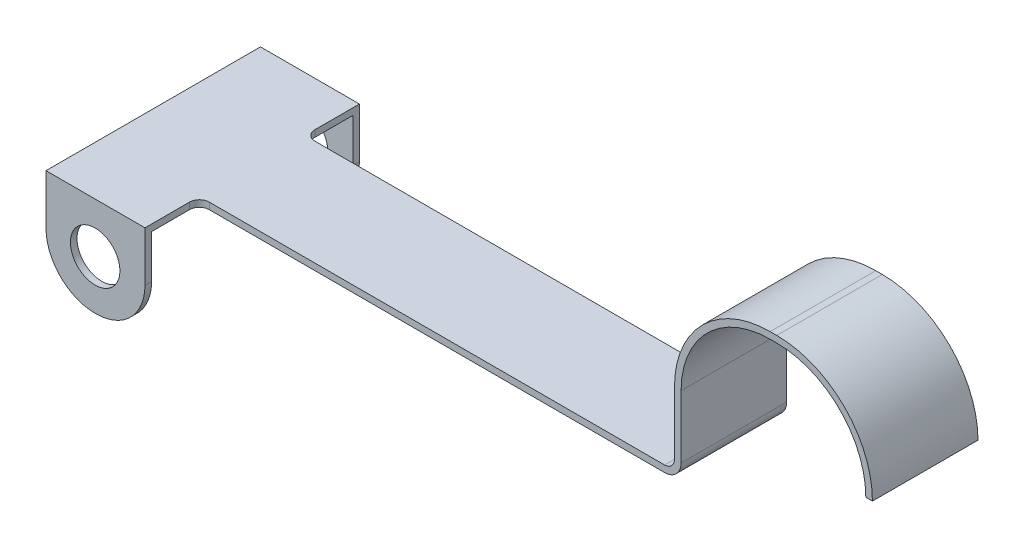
ISO-10303-21;
HEADER;
FILE_DESCRIPTION(('STEP AP214'),'2;1');
FILE_NAME('part.step','',(''),(''),'','','');
FILE_SCHEMA(('AUTOMOTIVE_DESIGN { 1 0 10303 214 1 1 1 1 }'));
ENDSEC;
DATA;
#1=APPLICATION_CONTEXT('core data for automotive mechanical design processes');
#2=APPLICATION_PROTOCOL_DEFINITION('international standard','automotive_design',2000,#1);
#3=PRODUCT_CONTEXT('',#1,'mechanical');
#4=PRODUCT('Part','Part','',(#3));
#5=PRODUCT_RELATED_PRODUCT_CATEGORY('part','',(#4));
#6=PRODUCT_DEFINITION_FORMATION('','',#4);
#7=PRODUCT_DEFINITION_CONTEXT('part definition',#1,'design');
#8=PRODUCT_DEFINITION('design','',#6,#7);
#9=PRODUCT_DEFINITION_SHAPE('','',#8);
#10=(LENGTH_UNIT() NAMED_UNIT(*) SI_UNIT(.MILLI.,.METRE.));
#11=(NAMED_UNIT(*) PLANE_ANGLE_UNIT() SI_UNIT($,.RADIAN.));
#12=(NAMED_UNIT(*) SI_UNIT($,.STERADIAN.) SOLID_ANGLE_UNIT());
#13=UNCERTAINTY_MEASURE_WITH_UNIT(LENGTH_MEASURE(1.E-05),#10,'distance_accuracy_value','');
#14=(GEOMETRIC_REPRESENTATION_CONTEXT(3) GLOBAL_UNCERTAINTY_ASSIGNED_CONTEXT((#13)) GLOBAL_UNIT_ASSIGNED_CONTEXT((#10,
#11,#12)) REPRESENTATION_CONTEXT('',''));
#15=CARTESIAN_POINT('',(0.,0.,0.));
#16=DIRECTION('',(0.,0.,1.));
#17=DIRECTION('',(1.,0.,0.));
#18=AXIS2_PLACEMENT_3D('',#15,#16,#17);
#19=CARTESIAN_POINT('',(-33.8702877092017,6.33331943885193,6.5));
#20=DIRECTION('',(0.,0.,-1.));
#21=DIRECTION('',(-1.,0.,0.));
#22=AXIS2_PLACEMENT_3D('',#19,#20,#21);
#23=CYLINDRICAL_SURFACE('',#22,1.49);
#24=DIRECTION('',(0.,0.,-1.));
#25=VECTOR('',#24,1.);
#26=CARTESIAN_POINT('',(-33.8702877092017,4.84331943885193,6.5));
#27=LINE('',#26,#25);
#28=CARTESIAN_POINT('',(-33.8702877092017,4.84331943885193,0.200000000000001));
#29=VERTEX_POINT('',#28);
#30=CARTESIAN_POINT('',(-33.8702877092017,4.84331943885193,0.));
#31=VERTEX_POINT('',#30);
#32=EDGE_CURVE('E413',#29,#31,#27,.T.);
#33=ORIENTED_EDGE('',*,*,#32,.F.);
#34=CARTESIAN_POINT('',(-33.8702877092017,6.33331943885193,0.200000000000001));
#35=DIRECTION('',(0.,0.,-1.));
#36=DIRECTION('',(-1.,0.,0.));
#37=AXIS2_PLACEMENT_3D('',#34,#35,#36);
#38=CIRCLE('',#37,1.49);
#39=CARTESIAN_POINT('',(-35.3602877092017,6.33331943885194,0.200000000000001));
#40=VERTEX_POINT('',#39);
#41=EDGE_CURVE('E271',#29,#40,#38,.T.);
#42=ORIENTED_EDGE('',*,*,#41,.T.);
#43=DIRECTION('',(0.,0.,-1.));
#44=VECTOR('',#43,1.);
#45=CARTESIAN_POINT('',(-35.3602877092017,6.33331943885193,6.5));
#46=LINE('',#45,#44);
#47=CARTESIAN_POINT('',(-35.3602877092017,6.33331943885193,0.));
#48=VERTEX_POINT('',#47);
#49=EDGE_CURVE('E417',#40,#48,#46,.T.);
#50=ORIENTED_EDGE('',*,*,#49,.T.);
#51=CARTESIAN_POINT('',(-33.8702877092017,6.33331943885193,0.));
#52=DIRECTION('',(0.,0.,1.));
#53=DIRECTION('',(1.,0.,0.));
#54=AXIS2_PLACEMENT_3D('',#51,#52,#53);
#55=CIRCLE('',#54,1.49);
#56=EDGE_CURVE('E340',#48,#31,#55,.T.);
#57=ORIENTED_EDGE('',*,*,#56,.T.);
#58=EDGE_LOOP('',(#33,#42,#50,#57));
#59=FACE_BOUND('',#58,.T.);
#60=ADVANCED_FACE('F31',(#59),#23,.T.);
#61=CARTESIAN_POINT('',(-33.8702877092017,4.84331943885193,6.5));
#62=DIRECTION('',(0.,1.,0.));
#63=DIRECTION('',(0.,0.,1.));
#64=AXIS2_PLACEMENT_3D('',#61,#62,#63);
#65=PLANE('',#64);
#66=DIRECTION('',(0.,0.,-1.));
#67=VECTOR('',#66,1.);
#68=CARTESIAN_POINT('',(-33.8502877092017,4.84331943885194,6.5));
#69=LINE('',#68,#67);
#70=CARTESIAN_POINT('',(-33.8502877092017,4.84331943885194,0.200000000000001));
#71=VERTEX_POINT('',#70);
#72=CARTESIAN_POINT('',(-33.8502877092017,4.84331943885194,0.));
#73=VERTEX_POINT('',#72);
#74=EDGE_CURVE('E409',#71,#73,#69,.T.);
#75=ORIENTED_EDGE('',*,*,#74,.F.);
#76=DIRECTION('',(-1.,0.,0.));
#77=VECTOR('',#76,1.);
#78=CARTESIAN_POINT('',(-33.8702877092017,4.84331943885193,0.200000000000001));
#79=LINE('',#78,#77);
#80=EDGE_CURVE('E268',#71,#29,#79,.T.);
#81=ORIENTED_EDGE('',*,*,#80,.T.);
#82=ORIENTED_EDGE('',*,*,#32,.T.);
#83=DIRECTION('',(1.,0.,0.));
#84=VECTOR('',#83,1.);
#85=CARTESIAN_POINT('',(-33.8702877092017,4.84331943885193,0.));
#86=LINE('',#85,#84);
#87=EDGE_CURVE('E343',#31,#73,#86,.T.);
#88=ORIENTED_EDGE('',*,*,#87,.T.);
#89=EDGE_LOOP('',(#75,#81,#82,#88));
#90=FACE_BOUND('',#89,.T.);
#91=ADVANCED_FACE('F543',(#90),#65,.F.);
#92=CARTESIAN_POINT('',(-33.8502877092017,6.33331943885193,6.5));
#93=DIRECTION('',(0.,0.,-1.));
#94=DIRECTION('',(-1.,0.,0.));
#95=AXIS2_PLACEMENT_3D('',#92,#93,#94);
#96=CYLINDRICAL_SURFACE('',#95,1.49);
#97=DIRECTION('',(0.,0.,-1.));
#98=VECTOR('',#97,1.);
#99=CARTESIAN_POINT('',(-32.3602877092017,6.33331943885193,6.5));
#100=LINE('',#99,#98);
#101=CARTESIAN_POINT('',(-32.3602877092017,6.33331943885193,0.200000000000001));
#102=VERTEX_POINT('',#101);
#103=CARTESIAN_POINT('',(-32.3602877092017,6.33331943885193,0.));
#104=VERTEX_POINT('',#103);
#105=EDGE_CURVE('E405',#102,#104,#100,.T.);
#106=ORIENTED_EDGE('',*,*,#105,.F.);
#107=CARTESIAN_POINT('',(-33.8502877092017,6.33331943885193,0.200000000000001));
#108=DIRECTION('',(0.,0.,-1.));
#109=DIRECTION('',(-1.,0.,0.));
#110=AXIS2_PLACEMENT_3D('',#107,#108,#109);
#111=CIRCLE('',#110,1.49);
#112=EDGE_CURVE('E265',#102,#71,#111,.T.);
#113=ORIENTED_EDGE('',*,*,#112,.T.);
#114=ORIENTED_EDGE('',*,*,#74,.T.);
#115=CARTESIAN_POINT('',(-33.8502877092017,6.33331943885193,0.));
#116=DIRECTION('',(0.,0.,1.));
#117=DIRECTION('',(1.,0.,0.));
#118=AXIS2_PLACEMENT_3D('',#115,#116,#117);
#119=CIRCLE('',#118,1.49);
#120=EDGE_CURVE('E346',#73,#104,#119,.T.);
#121=ORIENTED_EDGE('',*,*,#120,.T.);
#122=EDGE_LOOP('',(#106,#113,#114,#121));
#123=FACE_BOUND('',#122,.T.);
#124=ADVANCED_FACE('F545',(#123),#96,.T.);
#125=CARTESIAN_POINT('',(-32.3602877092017,7.34331943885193,6.5));
#126=DIRECTION('',(-1.,0.,0.));
#127=DIRECTION('',(0.,-1.,0.));
#128=AXIS2_PLACEMENT_3D('',#125,#126,#127);
#129=PLANE('',#128);
#130=DIRECTION('',(0.,0.,-1.));
#131=VECTOR('',#130,1.);
#132=CARTESIAN_POINT('',(-32.3602877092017,7.64331943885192,6.5));
#133=LINE('',#132,#131);
#134=CARTESIAN_POINT('',(-32.3602877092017,7.64331943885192,1.35));
#135=VERTEX_POINT('',#134);
#136=CARTESIAN_POINT('',(-32.3602877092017,7.64331943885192,0.200000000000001));
#137=VERTEX_POINT('',#136);
#138=EDGE_CURVE('E250',#135,#137,#133,.T.);
#139=ORIENTED_EDGE('',*,*,#138,.T.);
#140=DIRECTION('',(0.,-1.,0.));
#141=VECTOR('',#140,1.);
#142=CARTESIAN_POINT('',(-32.3602877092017,7.34331943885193,0.200000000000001));
#143=LINE('',#142,#141);
#144=EDGE_CURVE('E262',#137,#102,#143,.T.);
#145=ORIENTED_EDGE('',*,*,#144,.T.);
#146=ORIENTED_EDGE('',*,*,#105,.T.);
#147=DIRECTION('',(0.,1.,0.));
#148=VECTOR('',#147,1.);
#149=CARTESIAN_POINT('',(-32.3602877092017,7.34331943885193,0.));
#150=LINE('',#149,#148);
#151=CARTESIAN_POINT('',(-32.3602877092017,7.84331943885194,0.));
#152=VERTEX_POINT('',#151);
#153=EDGE_CURVE('E349',#104,#152,#150,.T.);
#154=ORIENTED_EDGE('',*,*,#153,.T.);
#155=DIRECTION('',(0.,0.,1.));
#156=VECTOR('',#155,1.);
#157=CARTESIAN_POINT('',(-32.3602877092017,7.84331943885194,6.5));
#158=LINE('',#157,#156);
#159=CARTESIAN_POINT('',(-32.3602877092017,7.84331943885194,1.35));
#160=VERTEX_POINT('',#159);
#161=EDGE_CURVE('E424',#152,#160,#158,.T.);
#162=ORIENTED_EDGE('',*,*,#161,.T.);
#163=DIRECTION('',(0.,1.,0.));
#164=VECTOR('',#163,1.);
#165=CARTESIAN_POINT('',(-32.3602877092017,4.84331943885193,1.35));
#166=LINE('',#165,#164);
#167=EDGE_CURVE('E285',#135,#160,#166,.T.);
#168=ORIENTED_EDGE('',*,*,#167,.F.);
#169=EDGE_LOOP('',(#139,#145,#146,#154,#162,#168));
#170=FACE_BOUND('',#169,.T.);
#171=ADVANCED_FACE('F437',(#170),#129,.F.);
#172=CARTESIAN_POINT('',(-33.8702877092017,6.33331943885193,6.5));
#173=DIRECTION('',(0.,0.,-1.));
#174=DIRECTION('',(-1.,0.,0.));
#175=AXIS2_PLACEMENT_3D('',#172,#173,#174);
#176=CYLINDRICAL_SURFACE('',#175,0.749999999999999);
#177=CARTESIAN_POINT('',(-33.8702877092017,6.33331943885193,0.200000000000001));
#178=DIRECTION('',(0.,0.,-1.));
#179=DIRECTION('',(-1.,0.,0.));
#180=AXIS2_PLACEMENT_3D('',#177,#178,#179);
#181=CIRCLE('',#180,0.749999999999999);
#182=CARTESIAN_POINT('',(-34.6202877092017,6.33331943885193,0.200000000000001));
#183=VERTEX_POINT('',#182);
#184=EDGE_CURVE('E35',#183,#183,#181,.T.);
#185=CARTESIAN_POINT('',(-33.8702877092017,6.33331943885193,0.));
#186=DIRECTION('',(0.,0.,1.));
#187=DIRECTION('',(1.,0.,0.));
#188=AXIS2_PLACEMENT_3D('',#185,#186,#187);
#189=CIRCLE('',#188,0.749999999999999);
#190=CARTESIAN_POINT('',(-34.6202877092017,6.33331943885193,0.));
#191=VERTEX_POINT('',#190);
#192=EDGE_CURVE('E331',#191,#191,#189,.T.);
#193=CARTESIAN_POINT('',(-34.6202877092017,6.33331943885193,0.200000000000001));
#194=CARTESIAN_POINT('',(-34.6202877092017,6.33331943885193,0.197916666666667));
#195=CARTESIAN_POINT('',(-34.6202877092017,6.33331943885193,0.195833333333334));
#196=CARTESIAN_POINT('',(-34.6202877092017,6.33331943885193,0.191666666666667));
#197=CARTESIAN_POINT('',(-34.6202877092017,6.33331943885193,0.189583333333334));
#198=CARTESIAN_POINT('',(-34.6202877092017,6.33331943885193,0.185416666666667));
#199=CARTESIAN_POINT('',(-34.6202877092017,6.33331943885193,0.183333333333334));
#200=CARTESIAN_POINT('',(-34.6202877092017,6.33331943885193,0.179166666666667));
#201=CARTESIAN_POINT('',(-34.6202877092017,6.33331943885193,0.177083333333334));
#202=CARTESIAN_POINT('',(-34.6202877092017,6.33331943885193,0.172916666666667));
#203=CARTESIAN_POINT('',(-34.6202877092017,6.33331943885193,0.170833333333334));
#204=CARTESIAN_POINT('',(-34.6202877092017,6.33331943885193,0.166666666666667));
#205=CARTESIAN_POINT('',(-34.6202877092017,6.33331943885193,0.164583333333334));
#206=CARTESIAN_POINT('',(-34.6202877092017,6.33331943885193,0.160416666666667));
#207=CARTESIAN_POINT('',(-34.6202877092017,6.33331943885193,0.158333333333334));
#208=CARTESIAN_POINT('',(-34.6202877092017,6.33331943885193,0.154166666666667));
#209=CARTESIAN_POINT('',(-34.6202877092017,6.33331943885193,0.152083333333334));
#210=CARTESIAN_POINT('',(-34.6202877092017,6.33331943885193,0.147916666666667));
#211=CARTESIAN_POINT('',(-34.6202877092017,6.33331943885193,0.145833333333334));
#212=CARTESIAN_POINT('',(-34.6202877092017,6.33331943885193,0.141666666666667));
#213=CARTESIAN_POINT('',(-34.6202877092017,6.33331943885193,0.139583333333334));
#214=CARTESIAN_POINT('',(-34.6202877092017,6.33331943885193,0.135416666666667));
#215=CARTESIAN_POINT('',(-34.6202877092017,6.33331943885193,0.133333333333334));
#216=CARTESIAN_POINT('',(-34.6202877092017,6.33331943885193,0.129166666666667));
#217=CARTESIAN_POINT('',(-34.6202877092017,6.33331943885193,0.127083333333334));
#218=CARTESIAN_POINT('',(-34.6202877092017,6.33331943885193,0.122916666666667));
#219=CARTESIAN_POINT('',(-34.6202877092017,6.33331943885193,0.120833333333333));
#220=CARTESIAN_POINT('',(-34.6202877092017,6.33331943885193,0.116666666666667));
#221=CARTESIAN_POINT('',(-34.6202877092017,6.33331943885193,0.114583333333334));
#222=CARTESIAN_POINT('',(-34.6202877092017,6.33331943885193,0.110416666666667));
#223=CARTESIAN_POINT('',(-34.6202877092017,6.33331943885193,0.108333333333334));
#224=CARTESIAN_POINT('',(-34.6202877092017,6.33331943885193,0.104166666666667));
#225=CARTESIAN_POINT('',(-34.6202877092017,6.33331943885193,0.102083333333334));
#226=CARTESIAN_POINT('',(-34.6202877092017,6.33331943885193,0.0979166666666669));
#227=CARTESIAN_POINT('',(-34.6202877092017,6.33331943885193,0.0958333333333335));
#228=CARTESIAN_POINT('',(-34.6202877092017,6.33331943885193,0.0916666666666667));
#229=CARTESIAN_POINT('',(-34.6202877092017,6.33331943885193,0.0895833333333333));
#230=CARTESIAN_POINT('',(-34.6202877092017,6.33331943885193,0.0854166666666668));
#231=CARTESIAN_POINT('',(-34.6202877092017,6.33331943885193,0.0833333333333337));
#232=CARTESIAN_POINT('',(-34.6202877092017,6.33331943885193,0.0791666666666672));
#233=CARTESIAN_POINT('',(-34.6202877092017,6.33331943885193,0.0770833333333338));
#234=CARTESIAN_POINT('',(-34.6202877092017,6.33331943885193,0.072916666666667));
#235=CARTESIAN_POINT('',(-34.6202877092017,6.33331943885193,0.0708333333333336));
#236=CARTESIAN_POINT('',(-34.6202877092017,6.33331943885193,0.0666666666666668));
#237=CARTESIAN_POINT('',(-34.6202877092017,6.33331943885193,0.0645833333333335));
#238=CARTESIAN_POINT('',(-34.6202877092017,6.33331943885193,0.0604166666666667));
#239=CARTESIAN_POINT('',(-34.6202877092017,6.33331943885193,0.0583333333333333));
#240=CARTESIAN_POINT('',(-34.6202877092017,6.33331943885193,0.0541666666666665));
#241=CARTESIAN_POINT('',(-34.6202877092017,6.33331943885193,0.0520833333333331));
#242=CARTESIAN_POINT('',(-34.6202877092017,6.33331943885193,0.0479166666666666));
#243=CARTESIAN_POINT('',(-34.6202877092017,6.33331943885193,0.0458333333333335));
#244=CARTESIAN_POINT('',(-34.6202877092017,6.33331943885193,0.041666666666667));
#245=CARTESIAN_POINT('',(-34.6202877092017,6.33331943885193,0.0395833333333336));
#246=CARTESIAN_POINT('',(-34.6202877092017,6.33331943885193,0.0354166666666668));
#247=CARTESIAN_POINT('',(-34.6202877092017,6.33331943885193,0.0333333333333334));
#248=CARTESIAN_POINT('',(-34.6202877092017,6.33331943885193,0.0291666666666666));
#249=CARTESIAN_POINT('',(-34.6202877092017,6.33331943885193,0.0270833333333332));
#250=CARTESIAN_POINT('',(-34.6202877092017,6.33331943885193,0.0229166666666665));
#251=CARTESIAN_POINT('',(-34.6202877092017,6.33331943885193,0.0208333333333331));
#252=CARTESIAN_POINT('',(-34.6202877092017,6.33331943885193,0.0166666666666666));
#253=CARTESIAN_POINT('',(-34.6202877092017,6.33331943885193,0.0145833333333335));
#254=CARTESIAN_POINT('',(-34.6202877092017,6.33331943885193,0.010416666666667));
#255=CARTESIAN_POINT('',(-34.6202877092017,6.33331943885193,0.00833333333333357));
#256=CARTESIAN_POINT('',(-34.6202877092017,6.33331943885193,0.00416666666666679));
#257=CARTESIAN_POINT('',(-34.6202877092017,6.33331943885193,0.00208333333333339));
#258=CARTESIAN_POINT('',(-34.6202877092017,6.33331943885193,0.));
#259=B_SPLINE_CURVE_WITH_KNOTS('',3,(#193,#194,#195,#196,#197,#198,#199,#200,#201,#202,#203,
#204,#205,#206,#207,#208,#209,#210,#211,#212,#213,#214,#215,#216,#217,#218,#219,#220,#221,#222,
#223,#224,#225,#226,#227,#228,#229,#230,#231,#232,#233,#234,#235,#236,#237,#238,#239,#240,#241,
#242,#243,#244,#245,#246,#247,#248,#249,#250,#251,#252,#253,#254,#255,#256,#257,#258),
.UNSPECIFIED.,.F.,.F.,(4,2,2,2,2,2,2,2,2,2,2,2,2,2,2,2,2,2,2,2,2,2,2,2,2,2,2,2,2,2,2,2,4),(0.,
0.00625000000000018,0.0125000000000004,0.0187499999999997,0.0249999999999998,0.03125,
0.0375000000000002,0.0437500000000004,0.0499999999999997,0.0562499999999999,0.0625000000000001,
0.0687500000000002,0.0750000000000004,0.0812500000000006,0.0874999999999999,0.0937500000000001,
0.1,0.10625,0.112500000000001,0.11875,0.125,0.13125,0.1375,0.143750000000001,0.150000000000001,
0.15625,0.1625,0.168750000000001,0.175000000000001,0.181250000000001,0.1875,0.19375,
0.200000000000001),.UNSPECIFIED.);
#260=EDGE_CURVE('BSEAM552',#183,#191,#259,.T.);
#261=ORIENTED_EDGE('',*,*,#184,.F.);
#262=ORIENTED_EDGE('',*,*,#192,.F.);
#263=ORIENTED_EDGE('',*,*,#260,.T.);
#264=ORIENTED_EDGE('',*,*,#260,.F.);
#265=EDGE_LOOP('',(#261,#263,#262,#264));
#266=FACE_BOUND('',#265,.T.);
#267=ADVANCED_FACE('F552',(#266),#176,.F.);
#268=CARTESIAN_POINT('',(-33.8702877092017,6.33331943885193,6.5));
#269=DIRECTION('',(0.,0.,1.));
#270=DIRECTION('',(1.,0.,0.));
#271=AXIS2_PLACEMENT_3D('',#268,#269,#270);
#272=PLANE('',#271);
#273=CARTESIAN_POINT('',(-33.8702877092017,6.33331943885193,6.5));
#274=DIRECTION('',(0.,0.,1.));
#275=DIRECTION('',(1.,0.,0.));
#276=AXIS2_PLACEMENT_3D('',#273,#274,#275);
#277=CIRCLE('',#276,0.749999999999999);
#278=CARTESIAN_POINT('',(-34.6202877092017,6.33331943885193,6.5));
#279=VERTEX_POINT('',#278);
#280=EDGE_CURVE('E334',#279,#279,#277,.T.);
#281=ORIENTED_EDGE('',*,*,#280,.F.);
#282=EDGE_LOOP('',(#281));
#283=FACE_BOUND('',#282,.T.);
#284=DIRECTION('',(0.,1.,0.));
#285=VECTOR('',#284,1.);
#286=CARTESIAN_POINT('',(-32.3602877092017,7.34331943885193,6.5));
#287=LINE('',#286,#285);
#288=CARTESIAN_POINT('',(-32.3602877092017,6.33331943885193,6.5));
#289=VERTEX_POINT('',#288);
#290=CARTESIAN_POINT('',(-32.3602877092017,7.84331943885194,6.5));
#291=VERTEX_POINT('',#290);
#292=EDGE_CURVE('E362',#289,#291,#287,.T.);
#293=ORIENTED_EDGE('',*,*,#292,.T.);
#294=DIRECTION('',(-1.,0.,0.));
#295=VECTOR('',#294,1.);
#296=CARTESIAN_POINT('',(-32.3602877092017,7.84331943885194,6.5));
#297=LINE('',#296,#295);
#298=CARTESIAN_POINT('',(-35.3602877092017,7.84331943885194,6.5));
#299=VERTEX_POINT('',#298);
#300=EDGE_CURVE('E364',#291,#299,#297,.T.);
#301=ORIENTED_EDGE('',*,*,#300,.T.);
#302=DIRECTION('',(0.,-1.,0.));
#303=VECTOR('',#302,1.);
#304=CARTESIAN_POINT('',(-35.3602877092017,7.84331943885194,6.5));
#305=LINE('',#304,#303);
#306=CARTESIAN_POINT('',(-35.3602877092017,6.33331943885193,6.5));
#307=VERTEX_POINT('',#306);
#308=EDGE_CURVE('E353',#299,#307,#305,.T.);
#309=ORIENTED_EDGE('',*,*,#308,.T.);
#310=CARTESIAN_POINT('',(-33.8702877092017,6.33331943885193,6.5));
#311=DIRECTION('',(0.,0.,1.));
#312=DIRECTION('',(1.,0.,0.));
#313=AXIS2_PLACEMENT_3D('',#310,#311,#312);
#314=CIRCLE('',#313,1.49);
#315=CARTESIAN_POINT('',(-33.8702877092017,4.84331943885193,6.5));
#316=VERTEX_POINT('',#315);
#317=EDGE_CURVE('E356',#307,#316,#314,.T.);
#318=ORIENTED_EDGE('',*,*,#317,.T.);
#319=DIRECTION('',(1.,0.,0.));
#320=VECTOR('',#319,1.);
#321=CARTESIAN_POINT('',(-33.8702877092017,4.84331943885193,6.5));
#322=LINE('',#321,#320);
#323=CARTESIAN_POINT('',(-33.8502877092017,4.84331943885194,6.5));
#324=VERTEX_POINT('',#323);
#325=EDGE_CURVE('E358',#316,#324,#322,.T.);
#326=ORIENTED_EDGE('',*,*,#325,.T.);
#327=CARTESIAN_POINT('',(-33.8502877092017,6.33331943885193,6.5));
#328=DIRECTION('',(0.,0.,1.));
#329=DIRECTION('',(1.,0.,0.));
#330=AXIS2_PLACEMENT_3D('',#327,#328,#329);
#331=CIRCLE('',#330,1.49);
#332=EDGE_CURVE('E360',#324,#289,#331,.T.);
#333=ORIENTED_EDGE('',*,*,#332,.T.);
#334=EDGE_LOOP('',(#293,#301,#309,#318,#326,#333));
#335=FACE_BOUND('',#334,.T.);
#336=ADVANCED_FACE('F517',(#283,#335),#272,.T.);
#337=CARTESIAN_POINT('',(-33.8702877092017,6.33331943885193,0.));
#338=DIRECTION('',(0.,0.,1.));
#339=DIRECTION('',(1.,0.,0.));
#340=AXIS2_PLACEMENT_3D('',#337,#338,#339);
#341=PLANE('',#340);
#342=ORIENTED_EDGE('',*,*,#192,.T.);
#343=EDGE_LOOP('',(#342));
#344=FACE_BOUND('',#343,.T.);
#345=DIRECTION('',(-1.,0.,0.));
#346=VECTOR('',#345,1.);
#347=CARTESIAN_POINT('',(-35.3602877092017,7.84331943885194,0.));
#348=LINE('',#347,#346);
#349=CARTESIAN_POINT('',(-35.3602877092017,7.84331943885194,0.));
#350=VERTEX_POINT('',#349);
#351=EDGE_CURVE('E351',#152,#350,#348,.T.);
#352=ORIENTED_EDGE('',*,*,#351,.F.);
#353=ORIENTED_EDGE('',*,*,#153,.F.);
#354=ORIENTED_EDGE('',*,*,#120,.F.);
#355=ORIENTED_EDGE('',*,*,#87,.F.);
#356=ORIENTED_EDGE('',*,*,#56,.F.);
#357=DIRECTION('',(0.,-1.,0.));
#358=VECTOR('',#357,1.);
#359=CARTESIAN_POINT('',(-35.3602877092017,7.84331943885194,0.));
#360=LINE('',#359,#358);
#361=EDGE_CURVE('E337',#350,#48,#360,.T.);
#362=ORIENTED_EDGE('',*,*,#361,.F.);
#363=EDGE_LOOP('',(#352,#353,#354,#355,#356,#362));
#364=FACE_BOUND('',#363,.T.);
#365=ADVANCED_FACE('F533',(#344,#364),#341,.F.);
#366=CARTESIAN_POINT('',(-32.0602877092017,7.64331943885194,6.5));
#367=DIRECTION('',(0.,1.,0.));
#368=DIRECTION('',(0.,0.,1.));
#369=AXIS2_PLACEMENT_3D('',#366,#367,#368);
#370=PLANE('',#369);
#371=DIRECTION('',(1.,0.,0.));
#372=VECTOR('',#371,1.);
#373=CARTESIAN_POINT('',(-32.0602877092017,7.64331943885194,4.85));
#374=LINE('',#373,#372);
#375=CARTESIAN_POINT('',(-32.0602877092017,7.64331943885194,4.85));
#376=VERTEX_POINT('',#375);
#377=CARTESIAN_POINT('',(-18.2602877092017,7.64331943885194,4.85));
#378=VERTEX_POINT('',#377);
#379=EDGE_CURVE('E329',#376,#378,#374,.T.);
#380=ORIENTED_EDGE('',*,*,#379,.F.);
#381=CARTESIAN_POINT('',(-32.0602877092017,7.64331943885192,5.15));
#382=DIRECTION('',(0.,1.,0.));
#383=DIRECTION('',(-1.,0.,0.));
#384=AXIS2_PLACEMENT_3D('',#381,#382,#383);
#385=CIRCLE('',#384,0.300000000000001);
#386=CARTESIAN_POINT('',(-32.3602877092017,7.64331943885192,5.15));
#387=VERTEX_POINT('',#386);
#388=EDGE_CURVE('E12',#376,#387,#385,.T.);
#389=ORIENTED_EDGE('',*,*,#388,.T.);
#390=CARTESIAN_POINT('',(-32.3602877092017,7.64331943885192,6.3));
#391=VERTEX_POINT('',#390);
#392=EDGE_CURVE('E240',#391,#387,#133,.T.);
#393=ORIENTED_EDGE('',*,*,#392,.F.);
#394=DIRECTION('',(-1.,0.,0.));
#395=VECTOR('',#394,1.);
#396=CARTESIAN_POINT('',(-11.9602877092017,7.64331943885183,6.3));
#397=LINE('',#396,#395);
#398=CARTESIAN_POINT('',(-35.3602877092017,7.64331943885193,6.3));
#399=VERTEX_POINT('',#398);
#400=EDGE_CURVE('E223',#391,#399,#397,.T.);
#401=ORIENTED_EDGE('',*,*,#400,.T.);
#402=DIRECTION('',(0.,0.,-1.));
#403=VECTOR('',#402,1.);
#404=CARTESIAN_POINT('',(-35.3602877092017,7.64331943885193,0.200000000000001));
#405=LINE('',#404,#403);
#406=CARTESIAN_POINT('',(-35.3602877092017,7.64331943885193,0.200000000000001));
#407=VERTEX_POINT('',#406);
#408=EDGE_CURVE('E231',#399,#407,#405,.T.);
#409=ORIENTED_EDGE('',*,*,#408,.T.);
#410=DIRECTION('',(-1.,0.,0.));
#411=VECTOR('',#410,1.);
#412=CARTESIAN_POINT('',(-11.9602877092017,7.64331943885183,0.200000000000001));
#413=LINE('',#412,#411);
#414=EDGE_CURVE('E241',#137,#407,#413,.T.);
#415=ORIENTED_EDGE('',*,*,#414,.F.);
#416=ORIENTED_EDGE('',*,*,#138,.F.);
#417=CARTESIAN_POINT('',(-32.0602877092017,7.64331943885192,1.35));
#418=DIRECTION('',(0.,1.,0.));
#419=DIRECTION('',(-1.,0.,0.));
#420=AXIS2_PLACEMENT_3D('',#417,#418,#419);
#421=CIRCLE('',#420,0.300000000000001);
#422=CARTESIAN_POINT('',(-32.0602877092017,7.64331943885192,1.65));
#423=VERTEX_POINT('',#422);
#424=EDGE_CURVE('E249',#135,#423,#421,.T.);
#425=ORIENTED_EDGE('',*,*,#424,.T.);
#426=DIRECTION('',(-1.,0.,0.));
#427=VECTOR('',#426,1.);
#428=CARTESIAN_POINT('',(-32.0602877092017,7.64331943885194,1.65));
#429=LINE('',#428,#427);
#430=CARTESIAN_POINT('',(-18.2602877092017,7.64331943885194,1.65));
#431=VERTEX_POINT('',#430);
#432=EDGE_CURVE('E307',#431,#423,#429,.T.);
#433=ORIENTED_EDGE('',*,*,#432,.F.);
#434=DIRECTION('',(0.,0.,-1.));
#435=VECTOR('',#434,1.);
#436=CARTESIAN_POINT('',(-18.2602877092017,7.64331943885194,6.5));
#437=LINE('',#436,#435);
#438=EDGE_CURVE('E402',#378,#431,#437,.T.);
#439=ORIENTED_EDGE('',*,*,#438,.F.);
#440=EDGE_LOOP('',(#380,#389,#393,#401,#409,#415,#416,#425,#433,#439));
#441=FACE_BOUND('',#440,.T.);
#442=ADVANCED_FACE('F237',(#441),#370,.F.);
#443=CARTESIAN_POINT('',(-18.2602877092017,8.14331943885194,6.5));
#444=DIRECTION('',(0.,0.,-1.));
#445=DIRECTION('',(-1.,0.,0.));
#446=AXIS2_PLACEMENT_3D('',#443,#444,#445);
#447=CYLINDRICAL_SURFACE('',#446,0.5);
#448=CARTESIAN_POINT('',(-18.2602877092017,8.14331943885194,4.85));
#449=DIRECTION('',(0.,0.,1.));
#450=DIRECTION('',(1.,0.,0.));
#451=AXIS2_PLACEMENT_3D('',#448,#449,#450);
#452=CIRCLE('',#451,0.5);
#453=CARTESIAN_POINT('',(-17.7602877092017,8.14331943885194,4.85));
#454=VERTEX_POINT('',#453);
#455=EDGE_CURVE('E327',#378,#454,#452,.T.);
#456=ORIENTED_EDGE('',*,*,#455,.F.);
#457=ORIENTED_EDGE('',*,*,#438,.T.);
#458=CARTESIAN_POINT('',(-18.2602877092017,8.14331943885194,1.65));
#459=DIRECTION('',(0.,0.,-1.));
#460=DIRECTION('',(-1.,0.,0.));
#461=AXIS2_PLACEMENT_3D('',#458,#459,#460);
#462=CIRCLE('',#461,0.5);
#463=CARTESIAN_POINT('',(-17.7602877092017,8.14331943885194,1.65));
#464=VERTEX_POINT('',#463);
#465=EDGE_CURVE('E305',#464,#431,#462,.T.);
#466=ORIENTED_EDGE('',*,*,#465,.F.);
#467=DIRECTION('',(0.,0.,-1.));
#468=VECTOR('',#467,1.);
#469=CARTESIAN_POINT('',(-17.7602877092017,8.14331943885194,6.5));
#470=LINE('',#469,#468);
#471=EDGE_CURVE('E399',#454,#464,#470,.T.);
#472=ORIENTED_EDGE('',*,*,#471,.F.);
#473=EDGE_LOOP('',(#456,#457,#466,#472));
#474=FACE_BOUND('',#473,.T.);
#475=ADVANCED_FACE('F502',(#474),#447,.T.);
#476=CARTESIAN_POINT('',(-17.7602877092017,8.14331943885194,6.5));
#477=DIRECTION('',(-1.,0.,0.));
#478=DIRECTION('',(0.,0.,1.));
#479=AXIS2_PLACEMENT_3D('',#476,#477,#478);
#480=PLANE('',#479);
#481=DIRECTION('',(0.,1.,0.));
#482=VECTOR('',#481,1.);
#483=CARTESIAN_POINT('',(-17.7602877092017,8.14331943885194,4.85));
#484=LINE('',#483,#482);
#485=CARTESIAN_POINT('',(-17.7602877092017,10.0433194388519,4.85));
#486=VERTEX_POINT('',#485);
#487=EDGE_CURVE('E325',#454,#486,#484,.T.);
#488=ORIENTED_EDGE('',*,*,#487,.F.);
#489=ORIENTED_EDGE('',*,*,#471,.T.);
#490=DIRECTION('',(0.,-1.,0.));
#491=VECTOR('',#490,1.);
#492=CARTESIAN_POINT('',(-17.7602877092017,8.14331943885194,1.65));
#493=LINE('',#492,#491);
#494=CARTESIAN_POINT('',(-17.7602877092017,10.0433194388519,1.65));
#495=VERTEX_POINT('',#494);
#496=EDGE_CURVE('E303',#495,#464,#493,.T.);
#497=ORIENTED_EDGE('',*,*,#496,.F.);
#498=DIRECTION('',(0.,0.,-1.));
#499=VECTOR('',#498,1.);
#500=CARTESIAN_POINT('',(-17.7602877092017,10.0433194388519,6.5));
#501=LINE('',#500,#499);
#502=EDGE_CURVE('E396',#486,#495,#501,.T.);
#503=ORIENTED_EDGE('',*,*,#502,.F.);
#504=EDGE_LOOP('',(#488,#489,#497,#503));
#505=FACE_BOUND('',#504,.T.);
#506=ADVANCED_FACE('F497',(#505),#480,.F.);
#507=CARTESIAN_POINT('',(-15.0602877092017,10.0433194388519,6.5));
#508=DIRECTION('',(0.,0.,-1.));
#509=DIRECTION('',(-1.,0.,0.));
#510=AXIS2_PLACEMENT_3D('',#507,#508,#509);
#511=CYLINDRICAL_SURFACE('',#510,2.7);
#512=CARTESIAN_POINT('',(-15.0602877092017,10.0433194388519,4.85));
#513=DIRECTION('',(0.,0.,1.));
#514=DIRECTION('',(1.,0.,0.));
#515=AXIS2_PLACEMENT_3D('',#512,#513,#514);
#516=CIRCLE('',#515,2.7);
#517=CARTESIAN_POINT('',(-15.0602877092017,12.7433194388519,4.85));
#518=VERTEX_POINT('',#517);
#519=EDGE_CURVE('E323',#486,#518,#516,.F.);
#520=ORIENTED_EDGE('',*,*,#519,.F.);
#521=ORIENTED_EDGE('',*,*,#502,.T.);
#522=CARTESIAN_POINT('',(-15.0602877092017,10.0433194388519,1.65));
#523=DIRECTION('',(0.,0.,-1.));
#524=DIRECTION('',(-1.,0.,0.));
#525=AXIS2_PLACEMENT_3D('',#522,#523,#524);
#526=CIRCLE('',#525,2.7);
#527=CARTESIAN_POINT('',(-15.0602877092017,12.7433194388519,1.65));
#528=VERTEX_POINT('',#527);
#529=EDGE_CURVE('E301',#528,#495,#526,.F.);
#530=ORIENTED_EDGE('',*,*,#529,.F.);
#531=DIRECTION('',(0.,0.,-1.));
#532=VECTOR('',#531,1.);
#533=CARTESIAN_POINT('',(-15.0602877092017,12.7433194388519,6.5));
#534=LINE('',#533,#532);
#535=EDGE_CURVE('E393',#518,#528,#534,.T.);
#536=ORIENTED_EDGE('',*,*,#535,.F.);
#537=EDGE_LOOP('',(#520,#521,#530,#536));
#538=FACE_BOUND('',#537,.T.);
#539=ADVANCED_FACE('F493',(#538),#511,.F.);
#540=CARTESIAN_POINT('',(-15.0602877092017,12.7433194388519,6.5));
#541=DIRECTION('',(0.,1.,0.));
#542=DIRECTION('',(-1.,0.,0.));
#543=AXIS2_PLACEMENT_3D('',#540,#541,#542);
#544=PLANE('',#543);
#545=DIRECTION('',(1.,0.,0.));
#546=VECTOR('',#545,1.);
#547=CARTESIAN_POINT('',(-15.0602877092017,12.7433194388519,4.85));
#548=LINE('',#547,#546);
#549=CARTESIAN_POINT('',(-14.8602877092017,12.7433194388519,4.85));
#550=VERTEX_POINT('',#549);
#551=EDGE_CURVE('E321',#518,#550,#548,.T.);
#552=ORIENTED_EDGE('',*,*,#551,.F.);
#553=ORIENTED_EDGE('',*,*,#535,.T.);
#554=DIRECTION('',(-1.,0.,0.));
#555=VECTOR('',#554,1.);
#556=CARTESIAN_POINT('',(-15.0602877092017,12.7433194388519,1.65));
#557=LINE('',#556,#555);
#558=CARTESIAN_POINT('',(-14.8602877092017,12.7433194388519,1.65));
#559=VERTEX_POINT('',#558);
#560=EDGE_CURVE('E299',#559,#528,#557,.T.);
#561=ORIENTED_EDGE('',*,*,#560,.F.);
#562=DIRECTION('',(0.,0.,-1.));
#563=VECTOR('',#562,1.);
#564=CARTESIAN_POINT('',(-14.8602877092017,12.7433194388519,6.5));
#565=LINE('',#564,#563);
#566=EDGE_CURVE('E390',#550,#559,#565,.T.);
#567=ORIENTED_EDGE('',*,*,#566,.F.);
#568=EDGE_LOOP('',(#552,#553,#561,#567));
#569=FACE_BOUND('',#568,.T.);
#570=ADVANCED_FACE('F487',(#569),#544,.F.);
#571=CARTESIAN_POINT('',(-14.8602877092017,10.0433194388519,6.5));
#572=DIRECTION('',(0.,0.,-1.));
#573=DIRECTION('',(-1.,0.,0.));
#574=AXIS2_PLACEMENT_3D('',#571,#572,#573);
#575=CYLINDRICAL_SURFACE('',#574,2.7);
#576=CARTESIAN_POINT('',(-14.8602877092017,10.0433194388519,4.85));
#577=DIRECTION('',(0.,0.,1.));
#578=DIRECTION('',(1.,0.,0.));
#579=AXIS2_PLACEMENT_3D('',#576,#577,#578);
#580=CIRCLE('',#579,2.7);
#581=CARTESIAN_POINT('',(-12.1602877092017,10.0433194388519,4.85));
#582=VERTEX_POINT('',#581);
#583=EDGE_CURVE('E319',#550,#582,#580,.F.);
#584=ORIENTED_EDGE('',*,*,#583,.F.);
#585=ORIENTED_EDGE('',*,*,#566,.T.);
#586=CARTESIAN_POINT('',(-14.8602877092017,10.0433194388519,1.65));
#587=DIRECTION('',(0.,0.,-1.));
#588=DIRECTION('',(-1.,0.,0.));
#589=AXIS2_PLACEMENT_3D('',#586,#587,#588);
#590=CIRCLE('',#589,2.7);
#591=CARTESIAN_POINT('',(-12.1602877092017,10.0433194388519,1.65));
#592=VERTEX_POINT('',#591);
#593=EDGE_CURVE('E297',#592,#559,#590,.F.);
#594=ORIENTED_EDGE('',*,*,#593,.F.);
#595=DIRECTION('',(0.,0.,-1.));
#596=VECTOR('',#595,1.);
#597=CARTESIAN_POINT('',(-12.1602877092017,10.0433194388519,6.5));
#598=LINE('',#597,#596);
#599=EDGE_CURVE('E387',#582,#592,#598,.T.);
#600=ORIENTED_EDGE('',*,*,#599,.F.);
#601=EDGE_LOOP('',(#584,#585,#594,#600));
#602=FACE_BOUND('',#601,.T.);
#603=ADVANCED_FACE('F483',(#602),#575,.F.);
#604=CARTESIAN_POINT('',(-12.1602877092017,10.0433194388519,6.5));
#605=DIRECTION('',(0.,1.,0.));
#606=DIRECTION('',(-1.,0.,0.));
#607=AXIS2_PLACEMENT_3D('',#604,#605,#606);
#608=PLANE('',#607);
#609=DIRECTION('',(1.,0.,0.));
#610=VECTOR('',#609,1.);
#611=CARTESIAN_POINT('',(-12.1602877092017,10.0433194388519,4.85));
#612=LINE('',#611,#610);
#613=CARTESIAN_POINT('',(-11.9602877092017,10.0433194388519,4.85));
#614=VERTEX_POINT('',#613);
#615=EDGE_CURVE('E317',#582,#614,#612,.T.);
#616=ORIENTED_EDGE('',*,*,#615,.F.);
#617=ORIENTED_EDGE('',*,*,#599,.T.);
#618=DIRECTION('',(-1.,0.,0.));
#619=VECTOR('',#618,1.);
#620=CARTESIAN_POINT('',(-12.1602877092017,10.0433194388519,1.65));
#621=LINE('',#620,#619);
#622=CARTESIAN_POINT('',(-11.9602877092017,10.0433194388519,1.65));
#623=VERTEX_POINT('',#622);
#624=EDGE_CURVE('E295',#623,#592,#621,.T.);
#625=ORIENTED_EDGE('',*,*,#624,.F.);
#626=DIRECTION('',(0.,0.,-1.));
#627=VECTOR('',#626,1.);
#628=CARTESIAN_POINT('',(-11.9602877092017,10.0433194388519,6.5));
#629=LINE('',#628,#627);
#630=EDGE_CURVE('E384',#614,#623,#629,.T.);
#631=ORIENTED_EDGE('',*,*,#630,.F.);
#632=EDGE_LOOP('',(#616,#617,#625,#631));
#633=FACE_BOUND('',#632,.T.);
#634=ADVANCED_FACE('F477',(#633),#608,.F.);
#635=CARTESIAN_POINT('',(-14.8602877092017,10.0433194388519,6.5));
#636=DIRECTION('',(0.,0.,-1.));
#637=DIRECTION('',(-1.,0.,0.));
#638=AXIS2_PLACEMENT_3D('',#635,#636,#637);
#639=CYLINDRICAL_SURFACE('',#638,2.9);
#640=CARTESIAN_POINT('',(-14.8602877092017,10.0433194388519,4.85));
#641=DIRECTION('',(0.,0.,1.));
#642=DIRECTION('',(1.,0.,0.));
#643=AXIS2_PLACEMENT_3D('',#640,#641,#642);
#644=CIRCLE('',#643,2.9);
#645=CARTESIAN_POINT('',(-14.8602877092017,12.9433194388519,4.85));
#646=VERTEX_POINT('',#645);
#647=EDGE_CURVE('E315',#614,#646,#644,.T.);
#648=ORIENTED_EDGE('',*,*,#647,.F.);
#649=ORIENTED_EDGE('',*,*,#630,.T.);
#650=CARTESIAN_POINT('',(-14.8602877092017,10.0433194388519,1.65));
#651=DIRECTION('',(0.,0.,-1.));
#652=DIRECTION('',(-1.,0.,0.));
#653=AXIS2_PLACEMENT_3D('',#650,#651,#652);
#654=CIRCLE('',#653,2.9);
#655=CARTESIAN_POINT('',(-14.8602877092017,12.9433194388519,1.65));
#656=VERTEX_POINT('',#655);
#657=EDGE_CURVE('E293',#656,#623,#654,.T.);
#658=ORIENTED_EDGE('',*,*,#657,.F.);
#659=DIRECTION('',(0.,0.,-1.));
#660=VECTOR('',#659,1.);
#661=CARTESIAN_POINT('',(-14.8602877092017,12.9433194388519,6.5));
#662=LINE('',#661,#660);
#663=EDGE_CURVE('E381',#646,#656,#662,.T.);
#664=ORIENTED_EDGE('',*,*,#663,.F.);
#665=EDGE_LOOP('',(#648,#649,#658,#664));
#666=FACE_BOUND('',#665,.T.);
#667=ADVANCED_FACE('F473',(#666),#639,.T.);
#668=CARTESIAN_POINT('',(-15.0602877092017,12.9433194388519,6.5));
#669=DIRECTION('',(0.,-1.,0.));
#670=DIRECTION('',(0.,0.,-1.));
#671=AXIS2_PLACEMENT_3D('',#668,#669,#670);
#672=PLANE('',#671);
#673=DIRECTION('',(1.,0.,0.));
#674=VECTOR('',#673,1.);
#675=CARTESIAN_POINT('',(-32.0602877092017,12.9433194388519,4.85));
#676=LINE('',#675,#674);
#677=CARTESIAN_POINT('',(-15.0602877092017,12.9433194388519,4.85));
#678=VERTEX_POINT('',#677);
#679=EDGE_CURVE('E277',#678,#646,#676,.T.);
#680=ORIENTED_EDGE('',*,*,#679,.T.);
#681=ORIENTED_EDGE('',*,*,#663,.T.);
#682=DIRECTION('',(-1.,0.,0.));
#683=VECTOR('',#682,1.);
#684=CARTESIAN_POINT('',(-32.0602877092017,12.9433194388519,1.65));
#685=LINE('',#684,#683);
#686=CARTESIAN_POINT('',(-15.0602877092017,12.9433194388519,1.65));
#687=VERTEX_POINT('',#686);
#688=EDGE_CURVE('E274',#656,#687,#685,.T.);
#689=ORIENTED_EDGE('',*,*,#688,.T.);
#690=DIRECTION('',(0.,0.,-1.));
#691=VECTOR('',#690,1.);
#692=CARTESIAN_POINT('',(-15.0602877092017,12.9433194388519,6.5));
#693=LINE('',#692,#691);
#694=EDGE_CURVE('E378',#678,#687,#693,.T.);
#695=ORIENTED_EDGE('',*,*,#694,.F.);
#696=EDGE_LOOP('',(#680,#681,#689,#695));
#697=FACE_BOUND('',#696,.T.);
#698=ADVANCED_FACE('F467',(#697),#672,.F.);
#699=CARTESIAN_POINT('',(-15.0602877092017,10.0433194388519,6.5));
#700=DIRECTION('',(0.,0.,-1.));
#701=DIRECTION('',(-1.,0.,0.));
#702=AXIS2_PLACEMENT_3D('',#699,#700,#701);
#703=CYLINDRICAL_SURFACE('',#702,2.9);
#704=CARTESIAN_POINT('',(-15.0602877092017,10.0433194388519,4.85));
#705=DIRECTION('',(0.,0.,1.));
#706=DIRECTION('',(1.,0.,0.));
#707=AXIS2_PLACEMENT_3D('',#704,#705,#706);
#708=CIRCLE('',#707,2.9);
#709=CARTESIAN_POINT('',(-17.9602877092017,10.0433194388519,4.85));
#710=VERTEX_POINT('',#709);
#711=EDGE_CURVE('E313',#678,#710,#708,.T.);
#712=ORIENTED_EDGE('',*,*,#711,.F.);
#713=ORIENTED_EDGE('',*,*,#694,.T.);
#714=CARTESIAN_POINT('',(-15.0602877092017,10.0433194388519,1.65));
#715=DIRECTION('',(0.,0.,-1.));
#716=DIRECTION('',(-1.,0.,0.));
#717=AXIS2_PLACEMENT_3D('',#714,#715,#716);
#718=CIRCLE('',#717,2.9);
#719=CARTESIAN_POINT('',(-17.9602877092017,10.0433194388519,1.65));
#720=VERTEX_POINT('',#719);
#721=EDGE_CURVE('E291',#720,#687,#718,.T.);
#722=ORIENTED_EDGE('',*,*,#721,.F.);
#723=DIRECTION('',(0.,0.,-1.));
#724=VECTOR('',#723,1.);
#725=CARTESIAN_POINT('',(-17.9602877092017,10.0433194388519,6.5));
#726=LINE('',#725,#724);
#727=EDGE_CURVE('E375',#710,#720,#726,.T.);
#728=ORIENTED_EDGE('',*,*,#727,.F.);
#729=EDGE_LOOP('',(#712,#713,#722,#728));
#730=FACE_BOUND('',#729,.T.);
#731=ADVANCED_FACE('F464',(#730),#703,.T.);
#732=CARTESIAN_POINT('',(-17.9602877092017,8.14331943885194,6.5));
#733=DIRECTION('',(1.,0.,0.));
#734=DIRECTION('',(0.,0.,-1.));
#735=AXIS2_PLACEMENT_3D('',#732,#733,#734);
#736=PLANE('',#735);
#737=DIRECTION('',(0.,-1.,0.));
#738=VECTOR('',#737,1.);
#739=CARTESIAN_POINT('',(-17.9602877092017,8.14331943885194,4.85));
#740=LINE('',#739,#738);
#741=CARTESIAN_POINT('',(-17.9602877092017,8.14331943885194,4.85));
#742=VERTEX_POINT('',#741);
#743=EDGE_CURVE('E311',#710,#742,#740,.T.);
#744=ORIENTED_EDGE('',*,*,#743,.F.);
#745=ORIENTED_EDGE('',*,*,#727,.T.);
#746=DIRECTION('',(0.,1.,0.));
#747=VECTOR('',#746,1.);
#748=CARTESIAN_POINT('',(-17.9602877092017,8.14331943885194,1.65));
#749=LINE('',#748,#747);
#750=CARTESIAN_POINT('',(-17.9602877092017,8.14331943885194,1.65));
#751=VERTEX_POINT('',#750);
#752=EDGE_CURVE('E289',#751,#720,#749,.T.);
#753=ORIENTED_EDGE('',*,*,#752,.F.);
#754=DIRECTION('',(0.,0.,-1.));
#755=VECTOR('',#754,1.);
#756=CARTESIAN_POINT('',(-17.9602877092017,8.14331943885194,6.5));
#757=LINE('',#756,#755);
#758=EDGE_CURVE('E372',#742,#751,#757,.T.);
#759=ORIENTED_EDGE('',*,*,#758,.F.);
#760=EDGE_LOOP('',(#744,#745,#753,#759));
#761=FACE_BOUND('',#760,.T.);
#762=ADVANCED_FACE('F459',(#761),#736,.F.);
#763=CARTESIAN_POINT('',(-18.2602877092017,8.14331943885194,6.5));
#764=DIRECTION('',(0.,0.,-1.));
#765=DIRECTION('',(-1.,0.,0.));
#766=AXIS2_PLACEMENT_3D('',#763,#764,#765);
#767=CYLINDRICAL_SURFACE('',#766,0.300000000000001);
#768=CARTESIAN_POINT('',(-18.2602877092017,8.14331943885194,4.85));
#769=DIRECTION('',(0.,0.,1.));
#770=DIRECTION('',(1.,0.,0.));
#771=AXIS2_PLACEMENT_3D('',#768,#769,#770);
#772=CIRCLE('',#771,0.300000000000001);
#773=CARTESIAN_POINT('',(-18.2602877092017,7.84331943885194,4.85));
#774=VERTEX_POINT('',#773);
#775=EDGE_CURVE('E309',#742,#774,#772,.F.);
#776=ORIENTED_EDGE('',*,*,#775,.F.);
#777=ORIENTED_EDGE('',*,*,#758,.T.);
#778=CARTESIAN_POINT('',(-18.2602877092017,8.14331943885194,1.65));
#779=DIRECTION('',(0.,0.,-1.));
#780=DIRECTION('',(-1.,0.,0.));
#781=AXIS2_PLACEMENT_3D('',#778,#779,#780);
#782=CIRCLE('',#781,0.300000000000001);
#783=CARTESIAN_POINT('',(-18.2602877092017,7.84331943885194,1.65));
#784=VERTEX_POINT('',#783);
#785=EDGE_CURVE('E283',#784,#751,#782,.F.);
#786=ORIENTED_EDGE('',*,*,#785,.F.);
#787=DIRECTION('',(0.,0.,-1.));
#788=VECTOR('',#787,1.);
#789=CARTESIAN_POINT('',(-18.2602877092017,7.84331943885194,6.5));
#790=LINE('',#789,#788);
#791=EDGE_CURVE('E369',#774,#784,#790,.T.);
#792=ORIENTED_EDGE('',*,*,#791,.F.);
#793=EDGE_LOOP('',(#776,#777,#786,#792));
#794=FACE_BOUND('',#793,.T.);
#795=ADVANCED_FACE('F455',(#794),#767,.F.);
#796=CARTESIAN_POINT('',(-35.3602877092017,7.84331943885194,6.5));
#797=DIRECTION('',(0.,-1.,0.));
#798=DIRECTION('',(0.,0.,-1.));
#799=AXIS2_PLACEMENT_3D('',#796,#797,#798);
#800=PLANE('',#799);
#801=DIRECTION('',(-1.,0.,0.));
#802=VECTOR('',#801,1.);
#803=CARTESIAN_POINT('',(-35.3602877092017,7.84331943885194,4.85));
#804=LINE('',#803,#802);
#805=CARTESIAN_POINT('',(-32.0602877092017,7.84331943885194,4.85));
#806=VERTEX_POINT('',#805);
#807=EDGE_CURVE('E40',#774,#806,#804,.T.);
#808=ORIENTED_EDGE('',*,*,#807,.F.);
#809=ORIENTED_EDGE('',*,*,#791,.T.);
#810=DIRECTION('',(1.,0.,0.));
#811=VECTOR('',#810,1.);
#812=CARTESIAN_POINT('',(-35.3602877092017,7.84331943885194,1.65));
#813=LINE('',#812,#811);
#814=CARTESIAN_POINT('',(-32.0602877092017,7.84331943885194,1.65));
#815=VERTEX_POINT('',#814);
#816=EDGE_CURVE('E420',#815,#784,#813,.T.);
#817=ORIENTED_EDGE('',*,*,#816,.F.);
#818=CARTESIAN_POINT('',(-32.0602877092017,7.84331943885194,1.35));
#819=DIRECTION('',(0.,-1.,0.));
#820=DIRECTION('',(0.,0.,-1.));
#821=AXIS2_PLACEMENT_3D('',#818,#819,#820);
#822=CIRCLE('',#821,0.300000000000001);
#823=EDGE_CURVE('E422',#160,#815,#822,.F.);
#824=ORIENTED_EDGE('',*,*,#823,.F.);
#825=ORIENTED_EDGE('',*,*,#161,.F.);
#826=ORIENTED_EDGE('',*,*,#351,.T.);
#827=DIRECTION('',(0.,0.,-1.));
#828=VECTOR('',#827,1.);
#829=CARTESIAN_POINT('',(-35.3602877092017,7.84331943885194,6.5));
#830=LINE('',#829,#828);
#831=EDGE_CURVE('E366',#299,#350,#830,.T.);
#832=ORIENTED_EDGE('',*,*,#831,.F.);
#833=ORIENTED_EDGE('',*,*,#300,.F.);
#834=DIRECTION('',(0.,0.,1.));
#835=VECTOR('',#834,1.);
#836=CARTESIAN_POINT('',(-32.3602877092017,7.84331943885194,6.5));
#837=LINE('',#836,#835);
#838=CARTESIAN_POINT('',(-32.3602877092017,7.84331943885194,5.15));
#839=VERTEX_POINT('',#838);
#840=EDGE_CURVE('E427',#839,#291,#837,.T.);
#841=ORIENTED_EDGE('',*,*,#840,.F.);
#842=CARTESIAN_POINT('',(-32.0602877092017,7.84331943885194,5.15));
#843=DIRECTION('',(0.,-1.,0.));
#844=DIRECTION('',(0.,0.,-1.));
#845=AXIS2_PLACEMENT_3D('',#842,#843,#844);
#846=CIRCLE('',#845,0.300000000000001);
#847=EDGE_CURVE('E429',#806,#839,#846,.F.);
#848=ORIENTED_EDGE('',*,*,#847,.F.);
#849=EDGE_LOOP('',(#808,#809,#817,#824,#825,#826,#832,#833,#841,#848));
#850=FACE_BOUND('',#849,.T.);
#851=ADVANCED_FACE('F448',(#850),#800,.F.);
#852=CARTESIAN_POINT('',(-35.3602877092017,7.84331943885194,6.5));
#853=DIRECTION('',(1.,0.,0.));
#854=DIRECTION('',(0.,1.,0.));
#855=AXIS2_PLACEMENT_3D('',#852,#853,#854);
#856=PLANE('',#855);
#857=ORIENTED_EDGE('',*,*,#49,.F.);
#858=DIRECTION('',(0.,-1.,0.));
#859=VECTOR('',#858,1.);
#860=CARTESIAN_POINT('',(-35.3602877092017,7.64331943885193,0.200000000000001));
#861=LINE('',#860,#859);
#862=EDGE_CURVE('E232',#407,#40,#861,.T.);
#863=ORIENTED_EDGE('',*,*,#862,.F.);
#864=ORIENTED_EDGE('',*,*,#408,.F.);
#865=DIRECTION('',(0.,1.,0.));
#866=VECTOR('',#865,1.);
#867=CARTESIAN_POINT('',(-35.3602877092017,7.64331943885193,6.3));
#868=LINE('',#867,#866);
#869=CARTESIAN_POINT('',(-35.3602877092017,6.33331943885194,6.3));
#870=VERTEX_POINT('',#869);
#871=EDGE_CURVE('E220',#870,#399,#868,.T.);
#872=ORIENTED_EDGE('',*,*,#871,.F.);
#873=EDGE_CURVE('E418',#307,#870,#46,.T.);
#874=ORIENTED_EDGE('',*,*,#873,.F.);
#875=ORIENTED_EDGE('',*,*,#308,.F.);
#876=ORIENTED_EDGE('',*,*,#831,.T.);
#877=ORIENTED_EDGE('',*,*,#361,.T.);
#878=EDGE_LOOP('',(#857,#863,#864,#872,#874,#875,#876,#877));
#879=FACE_BOUND('',#878,.T.);
#880=ADVANCED_FACE('F33',(#879),#856,.F.);
#881=ORIENTED_EDGE('',*,*,#873,.T.);
#882=CARTESIAN_POINT('',(-33.8702877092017,6.33331943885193,6.3));
#883=DIRECTION('',(0.,0.,1.));
#884=DIRECTION('',(1.,0.,0.));
#885=AXIS2_PLACEMENT_3D('',#882,#883,#884);
#886=CIRCLE('',#885,1.49);
#887=CARTESIAN_POINT('',(-33.8702877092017,4.84331943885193,6.3));
#888=VERTEX_POINT('',#887);
#889=EDGE_CURVE('E226',#870,#888,#886,.T.);
#890=ORIENTED_EDGE('',*,*,#889,.T.);
#891=EDGE_CURVE('E414',#316,#888,#27,.T.);
#892=ORIENTED_EDGE('',*,*,#891,.F.);
#893=ORIENTED_EDGE('',*,*,#317,.F.);
#894=EDGE_LOOP('',(#881,#890,#892,#893));
#895=FACE_BOUND('',#894,.T.);
#896=ADVANCED_FACE('F527',(#895),#23,.T.);
#897=ORIENTED_EDGE('',*,*,#891,.T.);
#898=DIRECTION('',(1.,0.,0.));
#899=VECTOR('',#898,1.);
#900=CARTESIAN_POINT('',(-33.8702877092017,4.84331943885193,6.3));
#901=LINE('',#900,#899);
#902=CARTESIAN_POINT('',(-33.8502877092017,4.84331943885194,6.3));
#903=VERTEX_POINT('',#902);
#904=EDGE_CURVE('E258',#888,#903,#901,.T.);
#905=ORIENTED_EDGE('',*,*,#904,.T.);
#906=EDGE_CURVE('E410',#324,#903,#69,.T.);
#907=ORIENTED_EDGE('',*,*,#906,.F.);
#908=ORIENTED_EDGE('',*,*,#325,.F.);
#909=EDGE_LOOP('',(#897,#905,#907,#908));
#910=FACE_BOUND('',#909,.T.);
#911=ADVANCED_FACE('F524',(#910),#65,.F.);
#912=ORIENTED_EDGE('',*,*,#906,.T.);
#913=CARTESIAN_POINT('',(-33.8502877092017,6.33331943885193,6.3));
#914=DIRECTION('',(0.,0.,1.));
#915=DIRECTION('',(1.,0.,0.));
#916=AXIS2_PLACEMENT_3D('',#913,#914,#915);
#917=CIRCLE('',#916,1.49);
#918=CARTESIAN_POINT('',(-32.3602877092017,6.33331943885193,6.3));
#919=VERTEX_POINT('',#918);
#920=EDGE_CURVE('E254',#903,#919,#917,.T.);
#921=ORIENTED_EDGE('',*,*,#920,.T.);
#922=EDGE_CURVE('E406',#289,#919,#100,.T.);
#923=ORIENTED_EDGE('',*,*,#922,.F.);
#924=ORIENTED_EDGE('',*,*,#332,.F.);
#925=EDGE_LOOP('',(#912,#921,#923,#924));
#926=FACE_BOUND('',#925,.T.);
#927=ADVANCED_FACE('F522',(#926),#96,.T.);
#928=DIRECTION('',(0.,1.,0.));
#929=VECTOR('',#928,1.);
#930=CARTESIAN_POINT('',(-32.3602877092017,7.34331943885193,6.3));
#931=LINE('',#930,#929);
#932=EDGE_CURVE('E252',#919,#391,#931,.T.);
#933=ORIENTED_EDGE('',*,*,#932,.T.);
#934=ORIENTED_EDGE('',*,*,#392,.T.);
#935=DIRECTION('',(0.,1.,0.));
#936=VECTOR('',#935,1.);
#937=CARTESIAN_POINT('',(-32.3602877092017,4.84331943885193,5.15));
#938=LINE('',#937,#936);
#939=EDGE_CURVE('E48',#387,#839,#938,.T.);
#940=ORIENTED_EDGE('',*,*,#939,.T.);
#941=ORIENTED_EDGE('',*,*,#840,.T.);
#942=ORIENTED_EDGE('',*,*,#292,.F.);
#943=ORIENTED_EDGE('',*,*,#922,.T.);
#944=EDGE_LOOP('',(#933,#934,#940,#941,#942,#943));
#945=FACE_BOUND('',#944,.T.);
#946=ADVANCED_FACE('F514',(#945),#129,.F.);
#947=CARTESIAN_POINT('',(-33.8702877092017,6.33331943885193,6.3));
#948=DIRECTION('',(0.,0.,1.));
#949=DIRECTION('',(1.,0.,0.));
#950=AXIS2_PLACEMENT_3D('',#947,#948,#949);
#951=CIRCLE('',#950,0.749999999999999);
#952=CARTESIAN_POINT('',(-34.6202877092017,6.33331943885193,6.3));
#953=VERTEX_POINT('',#952);
#954=EDGE_CURVE('E255',#953,#953,#951,.T.);
#955=CARTESIAN_POINT('',(-34.6202877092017,6.33331943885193,6.3));
#956=CARTESIAN_POINT('',(-34.6202877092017,6.33331943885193,6.30208333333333));
#957=CARTESIAN_POINT('',(-34.6202877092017,6.33331943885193,6.30416666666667));
#958=CARTESIAN_POINT('',(-34.6202877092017,6.33331943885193,6.30833333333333));
#959=CARTESIAN_POINT('',(-34.6202877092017,6.33331943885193,6.31041666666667));
#960=CARTESIAN_POINT('',(-34.6202877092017,6.33331943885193,6.31458333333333));
#961=CARTESIAN_POINT('',(-34.6202877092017,6.33331943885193,6.31666666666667));
#962=CARTESIAN_POINT('',(-34.6202877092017,6.33331943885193,6.32083333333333));
#963=CARTESIAN_POINT('',(-34.6202877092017,6.33331943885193,6.32291666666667));
#964=CARTESIAN_POINT('',(-34.6202877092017,6.33331943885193,6.32708333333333));
#965=CARTESIAN_POINT('',(-34.6202877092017,6.33331943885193,6.32916666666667));
#966=CARTESIAN_POINT('',(-34.6202877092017,6.33331943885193,6.33333333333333));
#967=CARTESIAN_POINT('',(-34.6202877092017,6.33331943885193,6.33541666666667));
#968=CARTESIAN_POINT('',(-34.6202877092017,6.33331943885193,6.33958333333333));
#969=CARTESIAN_POINT('',(-34.6202877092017,6.33331943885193,6.34166666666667));
#970=CARTESIAN_POINT('',(-34.6202877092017,6.33331943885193,6.34583333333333));
#971=CARTESIAN_POINT('',(-34.6202877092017,6.33331943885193,6.34791666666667));
#972=CARTESIAN_POINT('',(-34.6202877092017,6.33331943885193,6.35208333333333));
#973=CARTESIAN_POINT('',(-34.6202877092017,6.33331943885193,6.35416666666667));
#974=CARTESIAN_POINT('',(-34.6202877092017,6.33331943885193,6.35833333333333));
#975=CARTESIAN_POINT('',(-34.6202877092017,6.33331943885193,6.36041666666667));
#976=CARTESIAN_POINT('',(-34.6202877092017,6.33331943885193,6.36458333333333));
#977=CARTESIAN_POINT('',(-34.6202877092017,6.33331943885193,6.36666666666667));
#978=CARTESIAN_POINT('',(-34.6202877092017,6.33331943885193,6.37083333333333));
#979=CARTESIAN_POINT('',(-34.6202877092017,6.33331943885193,6.37291666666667));
#980=CARTESIAN_POINT('',(-34.6202877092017,6.33331943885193,6.37708333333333));
#981=CARTESIAN_POINT('',(-34.6202877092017,6.33331943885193,6.37916666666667));
#982=CARTESIAN_POINT('',(-34.6202877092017,6.33331943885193,6.38333333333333));
#983=CARTESIAN_POINT('',(-34.6202877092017,6.33331943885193,6.38541666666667));
#984=CARTESIAN_POINT('',(-34.6202877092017,6.33331943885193,6.38958333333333));
#985=CARTESIAN_POINT('',(-34.6202877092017,6.33331943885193,6.39166666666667));
#986=CARTESIAN_POINT('',(-34.6202877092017,6.33331943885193,6.39583333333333));
#987=CARTESIAN_POINT('',(-34.6202877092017,6.33331943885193,6.39791666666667));
#988=CARTESIAN_POINT('',(-34.6202877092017,6.33331943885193,6.40208333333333));
#989=CARTESIAN_POINT('',(-34.6202877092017,6.33331943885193,6.40416666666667));
#990=CARTESIAN_POINT('',(-34.6202877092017,6.33331943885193,6.40833333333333));
#991=CARTESIAN_POINT('',(-34.6202877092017,6.33331943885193,6.41041666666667));
#992=CARTESIAN_POINT('',(-34.6202877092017,6.33331943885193,6.41458333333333));
#993=CARTESIAN_POINT('',(-34.6202877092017,6.33331943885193,6.41666666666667));
#994=CARTESIAN_POINT('',(-34.6202877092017,6.33331943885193,6.42083333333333));
#995=CARTESIAN_POINT('',(-34.6202877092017,6.33331943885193,6.42291666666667));
#996=CARTESIAN_POINT('',(-34.6202877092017,6.33331943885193,6.42708333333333));
#997=CARTESIAN_POINT('',(-34.6202877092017,6.33331943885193,6.42916666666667));
#998=CARTESIAN_POINT('',(-34.6202877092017,6.33331943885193,6.43333333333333));
#999=CARTESIAN_POINT('',(-34.6202877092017,6.33331943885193,6.43541666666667));
#1000=CARTESIAN_POINT('',(-34.6202877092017,6.33331943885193,6.43958333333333));
#1001=CARTESIAN_POINT('',(-34.6202877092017,6.33331943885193,6.44166666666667));
#1002=CARTESIAN_POINT('',(-34.6202877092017,6.33331943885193,6.44583333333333));
#1003=CARTESIAN_POINT('',(-34.6202877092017,6.33331943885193,6.44791666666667));
#1004=CARTESIAN_POINT('',(-34.6202877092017,6.33331943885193,6.45208333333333));
#1005=CARTESIAN_POINT('',(-34.6202877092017,6.33331943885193,6.45416666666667));
#1006=CARTESIAN_POINT('',(-34.6202877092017,6.33331943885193,6.45833333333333));
#1007=CARTESIAN_POINT('',(-34.6202877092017,6.33331943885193,6.46041666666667));
#1008=CARTESIAN_POINT('',(-34.6202877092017,6.33331943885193,6.46458333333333));
#1009=CARTESIAN_POINT('',(-34.6202877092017,6.33331943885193,6.46666666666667));
#1010=CARTESIAN_POINT('',(-34.6202877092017,6.33331943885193,6.47083333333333));
#1011=CARTESIAN_POINT('',(-34.6202877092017,6.33331943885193,6.47291666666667));
#1012=CARTESIAN_POINT('',(-34.6202877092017,6.33331943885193,6.47708333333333));
#1013=CARTESIAN_POINT('',(-34.6202877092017,6.33331943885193,6.47916666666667));
#1014=CARTESIAN_POINT('',(-34.6202877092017,6.33331943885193,6.48333333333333));
#1015=CARTESIAN_POINT('',(-34.6202877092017,6.33331943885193,6.48541666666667));
#1016=CARTESIAN_POINT('',(-34.6202877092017,6.33331943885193,6.48958333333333));
#1017=CARTESIAN_POINT('',(-34.6202877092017,6.33331943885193,6.49166666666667));
#1018=CARTESIAN_POINT('',(-34.6202877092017,6.33331943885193,6.49583333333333));
#1019=CARTESIAN_POINT('',(-34.6202877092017,6.33331943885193,6.49791666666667));
#1020=CARTESIAN_POINT('',(-34.6202877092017,6.33331943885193,6.5));
#1021=B_SPLINE_CURVE_WITH_KNOTS('',3,(#955,#956,#957,#958,#959,#960,#961,#962,#963,#964,#965,
#966,#967,#968,#969,#970,#971,#972,#973,#974,#975,#976,#977,#978,#979,#980,#981,#982,#983,#984,
#985,#986,#987,#988,#989,#990,#991,#992,#993,#994,#995,#996,#997,#998,#999,#1000,#1001,#1002,
#1003,#1004,#1005,#1006,#1007,#1008,#1009,#1010,#1011,#1012,#1013,#1014,#1015,#1016,#1017,#1018,
#1019,#1020),.UNSPECIFIED.,.F.,.F.,(4,2,2,2,2,2,2,2,2,2,2,2,2,2,2,2,2,2,2,2,2,2,2,2,2,2,2,2,2,2,
2,2,4),(0.,0.00625000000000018,0.0125000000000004,0.0187500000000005,0.0250000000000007,0.03125,
0.0375000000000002,0.0437500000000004,0.0500000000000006,0.0562500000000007,0.0625000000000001,
0.0687500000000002,0.0750000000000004,0.0812500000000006,0.0874999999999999,0.0937500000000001,
0.1,0.10625,0.112500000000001,0.11875,0.125,0.13125,0.1375,0.14375,0.15,0.15625,0.1625,
0.168750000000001,0.175,0.18125,0.1875,0.19375,0.200000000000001),.UNSPECIFIED.);
#1022=EDGE_CURVE('BSEAM597',#953,#279,#1021,.T.);
#1023=ORIENTED_EDGE('',*,*,#954,.F.);
#1024=ORIENTED_EDGE('',*,*,#280,.T.);
#1025=ORIENTED_EDGE('',*,*,#1022,.T.);
#1026=ORIENTED_EDGE('',*,*,#1022,.F.);
#1027=EDGE_LOOP('',(#1023,#1025,#1024,#1026));
#1028=FACE_BOUND('',#1027,.T.);
#1029=ADVANCED_FACE('F597',(#1028),#176,.F.);
#1030=CARTESIAN_POINT('',(-32.0602877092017,4.84331943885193,1.65));
#1031=DIRECTION('',(0.,0.,-1.));
#1032=DIRECTION('',(-1.,0.,0.));
#1033=AXIS2_PLACEMENT_3D('',#1030,#1031,#1032);
#1034=PLANE('',#1033);
#1035=ORIENTED_EDGE('',*,*,#432,.T.);
#1036=DIRECTION('',(0.,1.,0.));
#1037=VECTOR('',#1036,1.);
#1038=CARTESIAN_POINT('',(-32.0602877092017,4.84331943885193,1.65));
#1039=LINE('',#1038,#1037);
#1040=EDGE_CURVE('E56',#423,#815,#1039,.T.);
#1041=ORIENTED_EDGE('',*,*,#1040,.T.);
#1042=ORIENTED_EDGE('',*,*,#816,.T.);
#1043=ORIENTED_EDGE('',*,*,#785,.T.);
#1044=ORIENTED_EDGE('',*,*,#752,.T.);
#1045=ORIENTED_EDGE('',*,*,#721,.T.);
#1046=ORIENTED_EDGE('',*,*,#688,.F.);
#1047=ORIENTED_EDGE('',*,*,#657,.T.);
#1048=ORIENTED_EDGE('',*,*,#624,.T.);
#1049=ORIENTED_EDGE('',*,*,#593,.T.);
#1050=ORIENTED_EDGE('',*,*,#560,.T.);
#1051=ORIENTED_EDGE('',*,*,#529,.T.);
#1052=ORIENTED_EDGE('',*,*,#496,.T.);
#1053=ORIENTED_EDGE('',*,*,#465,.T.);
#1054=EDGE_LOOP('',(#1035,#1041,#1042,#1043,#1044,#1045,#1046,#1047,#1048,#1049,#1050,#1051,
#1052,#1053));
#1055=FACE_BOUND('',#1054,.T.);
#1056=ADVANCED_FACE('F451',(#1055),#1034,.T.);
#1057=CARTESIAN_POINT('',(-32.0602877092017,4.84331943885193,1.35));
#1058=DIRECTION('',(0.,1.,0.));
#1059=DIRECTION('',(0.,0.,1.));
#1060=AXIS2_PLACEMENT_3D('',#1057,#1058,#1059);
#1061=CYLINDRICAL_SURFACE('',#1060,0.300000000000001);
#1062=ORIENTED_EDGE('',*,*,#424,.F.);
#1063=ORIENTED_EDGE('',*,*,#167,.T.);
#1064=ORIENTED_EDGE('',*,*,#823,.T.);
#1065=ORIENTED_EDGE('',*,*,#1040,.F.);
#1066=EDGE_LOOP('',(#1062,#1063,#1064,#1065));
#1067=FACE_BOUND('',#1066,.T.);
#1068=ADVANCED_FACE('F442',(#1067),#1061,.F.);
#1069=CARTESIAN_POINT('',(-32.0602877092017,4.84331943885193,4.85));
#1070=DIRECTION('',(0.,0.,1.));
#1071=DIRECTION('',(1.,0.,0.));
#1072=AXIS2_PLACEMENT_3D('',#1069,#1070,#1071);
#1073=PLANE('',#1072);
#1074=ORIENTED_EDGE('',*,*,#379,.T.);
#1075=ORIENTED_EDGE('',*,*,#455,.T.);
#1076=ORIENTED_EDGE('',*,*,#487,.T.);
#1077=ORIENTED_EDGE('',*,*,#519,.T.);
#1078=ORIENTED_EDGE('',*,*,#551,.T.);
#1079=ORIENTED_EDGE('',*,*,#583,.T.);
#1080=ORIENTED_EDGE('',*,*,#615,.T.);
#1081=ORIENTED_EDGE('',*,*,#647,.T.);
#1082=ORIENTED_EDGE('',*,*,#679,.F.);
#1083=ORIENTED_EDGE('',*,*,#711,.T.);
#1084=ORIENTED_EDGE('',*,*,#743,.T.);
#1085=ORIENTED_EDGE('',*,*,#775,.T.);
#1086=ORIENTED_EDGE('',*,*,#807,.T.);
#1087=DIRECTION('',(0.,1.,0.));
#1088=VECTOR('',#1087,1.);
#1089=CARTESIAN_POINT('',(-32.0602877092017,4.84331943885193,4.85));
#1090=LINE('',#1089,#1088);
#1091=EDGE_CURVE('E280',#376,#806,#1090,.T.);
#1092=ORIENTED_EDGE('',*,*,#1091,.F.);
#1093=EDGE_LOOP('',(#1074,#1075,#1076,#1077,#1078,#1079,#1080,#1081,#1082,#1083,#1084,#1085,
#1086,#1092));
#1094=FACE_BOUND('',#1093,.T.);
#1095=ADVANCED_FACE('F506',(#1094),#1073,.T.);
#1096=CARTESIAN_POINT('',(-32.0602877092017,4.84331943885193,5.15));
#1097=DIRECTION('',(0.,1.,0.));
#1098=DIRECTION('',(0.,0.,1.));
#1099=AXIS2_PLACEMENT_3D('',#1096,#1097,#1098);
#1100=CYLINDRICAL_SURFACE('',#1099,0.300000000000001);
#1101=ORIENTED_EDGE('',*,*,#388,.F.);
#1102=ORIENTED_EDGE('',*,*,#1091,.T.);
#1103=ORIENTED_EDGE('',*,*,#847,.T.);
#1104=ORIENTED_EDGE('',*,*,#939,.F.);
#1105=EDGE_LOOP('',(#1101,#1102,#1103,#1104));
#1106=FACE_BOUND('',#1105,.T.);
#1107=ADVANCED_FACE('F509',(#1106),#1100,.F.);
#1108=CARTESIAN_POINT('',(-11.9602877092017,7.64331943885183,0.200000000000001));
#1109=DIRECTION('',(0.,0.,-1.));
#1110=DIRECTION('',(-1.,0.,0.));
#1111=AXIS2_PLACEMENT_3D('',#1108,#1109,#1110);
#1112=PLANE('',#1111);
#1113=ORIENTED_EDGE('',*,*,#184,.T.);
#1114=EDGE_LOOP('',(#1113));
#1115=FACE_BOUND('',#1114,.T.);
#1116=ORIENTED_EDGE('',*,*,#80,.F.);
#1117=ORIENTED_EDGE('',*,*,#112,.F.);
#1118=ORIENTED_EDGE('',*,*,#144,.F.);
#1119=ORIENTED_EDGE('',*,*,#414,.T.);
#1120=ORIENTED_EDGE('',*,*,#862,.T.);
#1121=ORIENTED_EDGE('',*,*,#41,.F.);
#1122=EDGE_LOOP('',(#1116,#1117,#1118,#1119,#1120,#1121));
#1123=FACE_BOUND('',#1122,.T.);
#1124=ADVANCED_FACE('F540',(#1115,#1123),#1112,.F.);
#1125=CARTESIAN_POINT('',(-11.9602877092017,7.64331943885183,6.3));
#1126=DIRECTION('',(0.,0.,1.));
#1127=DIRECTION('',(1.,0.,0.));
#1128=AXIS2_PLACEMENT_3D('',#1125,#1126,#1127);
#1129=PLANE('',#1128);
#1130=ORIENTED_EDGE('',*,*,#954,.T.);
#1131=EDGE_LOOP('',(#1130));
#1132=FACE_BOUND('',#1131,.T.);
#1133=ORIENTED_EDGE('',*,*,#871,.T.);
#1134=ORIENTED_EDGE('',*,*,#400,.F.);
#1135=ORIENTED_EDGE('',*,*,#932,.F.);
#1136=ORIENTED_EDGE('',*,*,#920,.F.);
#1137=ORIENTED_EDGE('',*,*,#904,.F.);
#1138=ORIENTED_EDGE('',*,*,#889,.F.);
#1139=EDGE_LOOP('',(#1133,#1134,#1135,#1136,#1137,#1138));
#1140=FACE_BOUND('',#1139,.T.);
#1141=ADVANCED_FACE('F222',(#1132,#1140),#1129,.F.);
#1142=CLOSED_SHELL('',(#60,#91,#124,#171,#267,#336,#365,#442,#475,#506,#539,#570,#603,#634,#667,
#698,#731,#762,#795,#851,#880,#896,#911,#927,#946,#1029,#1056,#1068,#1095,#1107,#1124,#1141));
#1143=MANIFOLD_SOLID_BREP('B2',#1142);
#1144=ADVANCED_BREP_SHAPE_REPRESENTATION('',(#18,#1143),#14);
#1145=SHAPE_DEFINITION_REPRESENTATION(#9,#1144);
ENDSEC;
END-ISO-10303-21;
